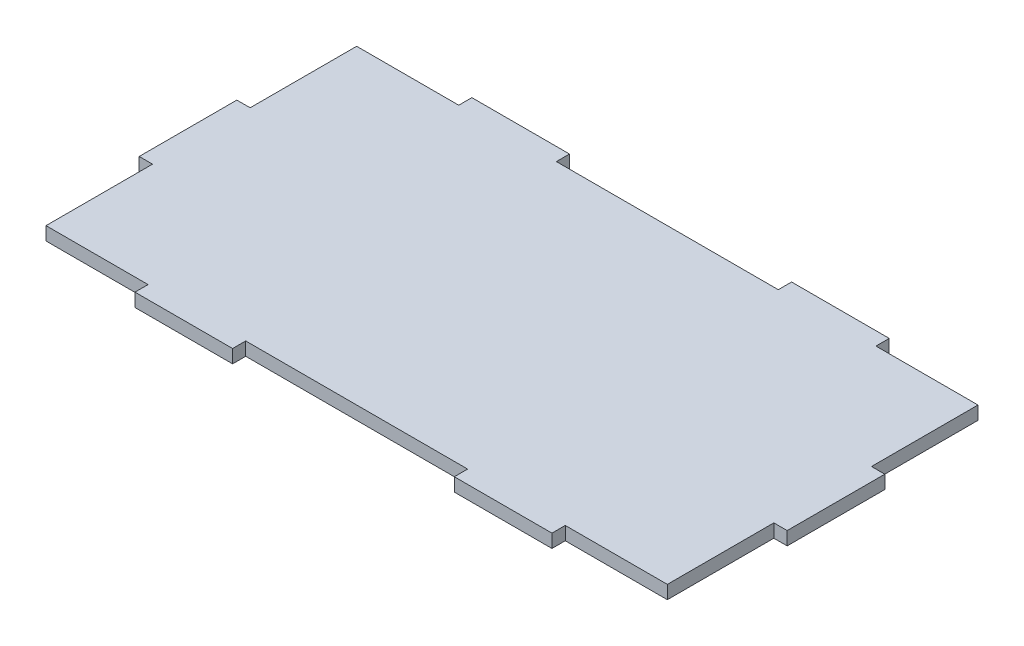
from build123d import *

# Parameters (mm, degrees)
BOSS_EXTRUDE1_DEPTH = 3


with BuildPart() as part:
    # Sketch1 → Boss-Extrude1 (new body)
    with BuildSketch(Plane(origin=(0, 0, 0), x_dir=(1, 0, 0), z_dir=(0, 1, 0))):
        Polygon((70.80457377, -34.064558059), (70.80457377, -10.064558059), (73.80457377, -10.064558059), (73.80457377, 11.935441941), (70.80457377, 11.935441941), (70.80457377, 35.935441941), (47.80457377, 35.935441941), (47.80457377, 38.935441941), (25.80457377, 38.935441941), (25.80457377, 35.935441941), (-24.19542623, 35.935441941), (-24.19542623, 38.890654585), (-46.19542623, 38.890654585), (-46.19542623, 35.935441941), (-69.19542623, 35.935441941), (-69.19542623, 11.935441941), (-72.19542623, 11.935441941), (-72.19542623, -10.064558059), (-69.19542623, -10.064558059), (-69.19542623, -34.064558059), (-46.19542623, -34.064558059), (-46.19542623, -37.019770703), (-24.19542623, -37.019770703), (-24.19542623, -34.064558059), (25.80457377, -34.064558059), (25.80457377, -37.064558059), (47.80457377, -37.064558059), (47.80457377, -34.064558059), align=None)
    extrude(amount=BOSS_EXTRUDE1_DEPTH)


solid = part.part
